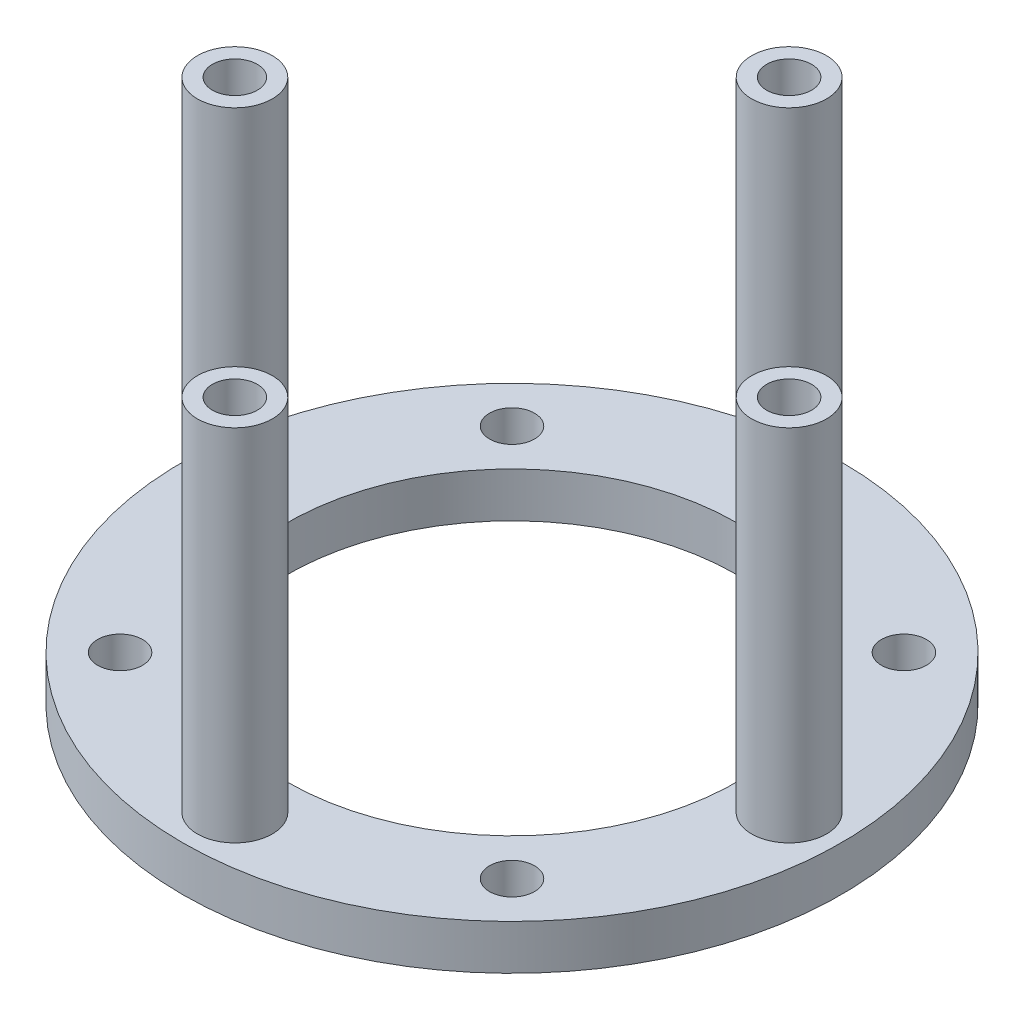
from build123d import *

# Parameters (mm, degrees)
SKETCH1_R           = 22
SKETCH1_R_2         = 15
BOSS_EXTRUDE1_DEPTH = 3
SKETCH3_R           = 2.5
BOSS_EXTRUDE2_DEPTH = 24
SKETCH4_R           = 1.5
CUT_EXTRUDE1_DEPTH  = 6
SKETCH5_R           = 1.5
CUT_EXTRUDE2_DEPTH  = 6


with BuildPart() as part:
    # Sketch1 → Boss-Extrude1 (new body)
    with BuildSketch(Plane(origin=(0, 0, 0), x_dir=(1, 0, 0), z_dir=(0, 1, 0))):
        with Locations(Location((0, 0, 0), (0, 0, 270))):
            Circle(SKETCH1_R)
        with Locations(Location((0, 0, 0), (0, 0, 270))):
            Circle(SKETCH1_R_2, mode=Mode.SUBTRACT)
    extrude(amount=BOSS_EXTRUDE1_DEPTH)

    # Sketch3 → Boss-Extrude2 (add)
    with BuildSketch(Plane(origin=(0, 3, 0), x_dir=(1, 0, 0), z_dir=(0, 1, 0))):
        with Locations(Location((0, 18.5, 0), (0, 0, 270))):
            Circle(SKETCH3_R)
        with Locations(Location((18.5, 0, 0), (0, 0, 270))):
            Circle(SKETCH3_R)
        with Locations(Location((0, -18.5, 0), (0, 0, 270))):
            Circle(SKETCH3_R)
        with Locations(Location((-18.5, 0, 0), (0, 0, 270))):
            Circle(SKETCH3_R)
    extrude(amount=BOSS_EXTRUDE2_DEPTH)

    # Sketch4 → Cut-Extrude1 (cut)
    with BuildSketch(Plane(origin=(0, 27, 0), x_dir=(1, 0, 0), z_dir=(0, 1, 0))):
        with Locations(Location((-18.5, 0, 0), (0, 0, 270))):
            Circle(SKETCH4_R)
        with Locations(Location((0, 18.5, 0), (0, 0, 270))):
            Circle(SKETCH4_R)
        with Locations(Location((18.5, 0, 0), (0, 0, 270))):
            Circle(SKETCH4_R)
        with Locations(Location((0, -18.5, 0), (0, 0, 270))):
            Circle(SKETCH4_R)
    extrude(amount=-CUT_EXTRUDE1_DEPTH, mode=Mode.SUBTRACT)

    # Sketch5 → Cut-Extrude2 (cut)
    with BuildSketch(Plane(origin=(0, 3, 0), x_dir=(1, 0, 0), z_dir=(0, 1, 0))):
        with Locations(Location((13.081475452, 13.081475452, 0), (0, 0, 270))):
            Circle(SKETCH5_R)
        with Locations(Location((13.081475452, -13.081475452, 0), (0, 0, 270))):
            Circle(SKETCH5_R)
        with Locations(Location((-13.081475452, -13.081475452, 0), (0, 0, 270))):
            Circle(SKETCH5_R)
        with Locations(Location((-13.081475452, 13.081475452, 0), (0, 0, 270))):
            Circle(SKETCH5_R)
    extrude(amount=-CUT_EXTRUDE2_DEPTH, mode=Mode.SUBTRACT)


solid = part.part
